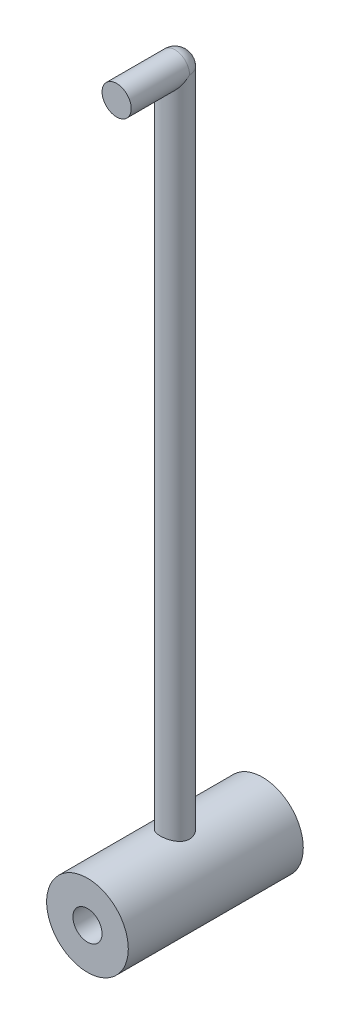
ISO-10303-21;
HEADER;
FILE_DESCRIPTION(('STEP AP214'),'2;1');
FILE_NAME('part.step','',(''),(''),'','','');
FILE_SCHEMA(('AUTOMOTIVE_DESIGN { 1 0 10303 214 1 1 1 1 }'));
ENDSEC;
DATA;
#1=APPLICATION_CONTEXT('core data for automotive mechanical design processes');
#2=APPLICATION_PROTOCOL_DEFINITION('international standard','automotive_design',2000,#1);
#3=PRODUCT_CONTEXT('',#1,'mechanical');
#4=PRODUCT('Part','Part','',(#3));
#5=PRODUCT_RELATED_PRODUCT_CATEGORY('part','',(#4));
#6=PRODUCT_DEFINITION_FORMATION('','',#4);
#7=PRODUCT_DEFINITION_CONTEXT('part definition',#1,'design');
#8=PRODUCT_DEFINITION('design','',#6,#7);
#9=PRODUCT_DEFINITION_SHAPE('','',#8);
#10=(LENGTH_UNIT() NAMED_UNIT(*) SI_UNIT(.MILLI.,.METRE.));
#11=(NAMED_UNIT(*) PLANE_ANGLE_UNIT() SI_UNIT($,.RADIAN.));
#12=(NAMED_UNIT(*) SI_UNIT($,.STERADIAN.) SOLID_ANGLE_UNIT());
#13=UNCERTAINTY_MEASURE_WITH_UNIT(LENGTH_MEASURE(1.E-05),#10,'distance_accuracy_value','');
#14=(GEOMETRIC_REPRESENTATION_CONTEXT(3) GLOBAL_UNCERTAINTY_ASSIGNED_CONTEXT((#13)) GLOBAL_UNIT_ASSIGNED_CONTEXT((#10,
#11,#12)) REPRESENTATION_CONTEXT('',''));
#15=CARTESIAN_POINT('',(0.,0.,0.));
#16=DIRECTION('',(0.,0.,1.));
#17=DIRECTION('',(1.,0.,0.));
#18=AXIS2_PLACEMENT_3D('',#15,#16,#17);
#19=CARTESIAN_POINT('',(0.,120.,0.));
#20=DIRECTION('',(0.,-1.,0.));
#21=DIRECTION('',(0.,0.,-1.));
#22=AXIS2_PLACEMENT_3D('',#19,#20,#21);
#23=CYLINDRICAL_SURFACE('',#22,2.5);
#24=CARTESIAN_POINT('',(0.,7.,-2.5));
#25=CARTESIAN_POINT('',(-0.135839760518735,7.0000020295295,-2.50000282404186));
#26=CARTESIAN_POINT('',(-0.271659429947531,6.99601056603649,-2.48889324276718));
#27=CARTESIAN_POINT('',(-0.539264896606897,6.98048404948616,-2.44490871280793));
#28=CARTESIAN_POINT('',(-0.671050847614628,6.96894928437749,-2.41203459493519));
#29=CARTESIAN_POINT('',(-0.926692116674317,6.93958109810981,-2.32581485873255));
#30=CARTESIAN_POINT('',(-1.05056137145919,6.92175912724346,-2.27250644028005));
#31=CARTESIAN_POINT('',(-1.28759585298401,6.88161078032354,-2.14711128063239));
#32=CARTESIAN_POINT('',(-1.40075850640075,6.85928332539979,-2.07502004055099));
#33=CARTESIAN_POINT('',(-1.61758802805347,6.81147377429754,-1.9111568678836));
#34=CARTESIAN_POINT('',(-1.72078015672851,6.78590827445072,-1.81878126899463));
#35=CARTESIAN_POINT('',(-1.9105819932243,6.73493522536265,-1.61825363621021));
#36=CARTESIAN_POINT('',(-1.99718728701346,6.70952771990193,-1.51009741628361));
#37=CARTESIAN_POINT('',(-2.15423735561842,6.6608007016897,-1.27660220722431));
#38=CARTESIAN_POINT('',(-2.2240352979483,6.63758107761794,-1.15080525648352));
#39=CARTESIAN_POINT('',(-2.34127572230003,6.59714352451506,-0.888296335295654));
#40=CARTESIAN_POINT('',(-2.38872619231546,6.57992345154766,-0.751588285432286));
#41=CARTESIAN_POINT('',(-2.45809130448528,6.55432038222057,-0.476577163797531));
#42=CARTESIAN_POINT('',(-2.48090519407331,6.54562733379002,-0.33853069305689));
#43=CARTESIAN_POINT('',(-2.5031615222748,6.53715061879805,-0.060316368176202));
#44=CARTESIAN_POINT('',(-2.50261249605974,6.53736369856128,0.0798506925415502));
#45=CARTESIAN_POINT('',(-2.4788507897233,6.54640588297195,0.350355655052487));
#46=CARTESIAN_POINT('',(-2.45685161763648,6.55477363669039,0.480818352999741));
#47=CARTESIAN_POINT('',(-2.3928085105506,6.57842082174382,0.736061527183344));
#48=CARTESIAN_POINT('',(-2.35076183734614,6.59370119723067,0.860841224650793));
#49=CARTESIAN_POINT('',(-2.247095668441,6.62975170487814,1.10377374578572));
#50=CARTESIAN_POINT('',(-2.18514195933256,6.65061447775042,1.22176960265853));
#51=CARTESIAN_POINT('',(-2.04365272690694,6.69544469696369,1.44605638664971));
#52=CARTESIAN_POINT('',(-1.96411154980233,6.71941314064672,1.55234353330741));
#53=CARTESIAN_POINT('',(-1.78403149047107,6.76952498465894,1.75695959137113));
#54=CARTESIAN_POINT('',(-1.68251331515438,6.7957122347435,1.85441785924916));
#55=CARTESIAN_POINT('',(-1.46426184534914,6.84605473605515,2.03117168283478));
#56=CARTESIAN_POINT('',(-1.3475266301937,6.87020973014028,2.11046494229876));
#57=CARTESIAN_POINT('',(-1.10010034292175,6.91416998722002,2.2494806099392));
#58=CARTESIAN_POINT('',(-0.969249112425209,6.93391532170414,2.30893823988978));
#59=CARTESIAN_POINT('',(-0.698523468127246,6.96639167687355,2.40471582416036));
#60=CARTESIAN_POINT('',(-0.558652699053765,6.97912551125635,2.44104506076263));
#61=CARTESIAN_POINT('',(-0.281205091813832,6.99566202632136,2.48791915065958));
#62=CARTESIAN_POINT('',(-0.143850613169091,6.99987103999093,2.49963813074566));
#63=CARTESIAN_POINT('',(0.130909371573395,7.00012297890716,2.50034512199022));
#64=CARTESIAN_POINT('',(0.268314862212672,6.99616751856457,2.48933762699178));
#65=CARTESIAN_POINT('',(0.534368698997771,6.98080349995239,2.44581386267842));
#66=CARTESIAN_POINT('',(0.663155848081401,6.96965417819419,2.41404524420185));
#67=CARTESIAN_POINT('',(0.913499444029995,6.94128245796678,2.33086340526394));
#68=CARTESIAN_POINT('',(1.03505494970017,6.9240592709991,2.27944763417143));
#69=CARTESIAN_POINT('',(1.27131790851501,6.88465739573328,2.15684114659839));
#70=CARTESIAN_POINT('',(1.38573546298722,6.86235262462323,2.08513351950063));
#71=CARTESIAN_POINT('',(1.60127936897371,6.81528395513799,1.92457250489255));
#72=CARTESIAN_POINT('',(1.70240114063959,6.79051921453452,1.83571323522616));
#73=CARTESIAN_POINT('',(1.89402292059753,6.73966040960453,1.63787036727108));
#74=CARTESIAN_POINT('',(1.98368681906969,6.71356479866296,1.52807528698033));
#75=CARTESIAN_POINT('',(2.14345525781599,6.6642787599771,1.29445872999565));
#76=CARTESIAN_POINT('',(2.21355884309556,6.64108847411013,1.17063656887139));
#77=CARTESIAN_POINT('',(2.33208686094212,6.60040332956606,0.911935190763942));
#78=CARTESIAN_POINT('',(2.3804881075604,6.58291456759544,0.777044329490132));
#79=CARTESIAN_POINT('',(2.45361419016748,6.55601442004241,0.500239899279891));
#80=CARTESIAN_POINT('',(2.4783518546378,6.54659865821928,0.358330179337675));
#81=CARTESIAN_POINT('',(2.50236255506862,6.53745596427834,0.0804795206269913));
#82=CARTESIAN_POINT('',(2.50304426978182,6.53719306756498,-0.0553232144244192));
#83=CARTESIAN_POINT('',(2.48247035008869,6.54503319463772,-0.324997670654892));
#84=CARTESIAN_POINT('',(2.46121642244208,6.55313556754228,-0.458869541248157));
#85=CARTESIAN_POINT('',(2.39843007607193,6.57636700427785,-0.71750058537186));
#86=CARTESIAN_POINT('',(2.35741961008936,6.59131474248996,-0.84240409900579));
#87=CARTESIAN_POINT('',(2.25672644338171,6.62646329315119,-1.08364268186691));
#88=CARTESIAN_POINT('',(2.19703924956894,6.64666536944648,-1.1999756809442));
#89=CARTESIAN_POINT('',(2.05730313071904,6.69127230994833,-1.42692574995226));
#90=CARTESIAN_POINT('',(1.97640371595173,6.71583400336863,-1.53698804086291));
#91=CARTESIAN_POINT('',(1.79790863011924,6.76580411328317,-1.74242750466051));
#92=CARTESIAN_POINT('',(1.70030791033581,6.79121278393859,-1.83780022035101));
#93=CARTESIAN_POINT('',(1.48566252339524,6.84145445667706,-2.01572190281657));
#94=CARTESIAN_POINT('',(1.36791750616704,6.86620367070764,-2.09745303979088));
#95=CARTESIAN_POINT('',(1.11951131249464,6.91104924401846,-2.23990766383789));
#96=CARTESIAN_POINT('',(0.988851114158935,6.93114595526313,-2.3006327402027));
#97=CARTESIAN_POINT('',(0.717646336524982,6.96446006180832,-2.39914031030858));
#98=CARTESIAN_POINT('',(0.577062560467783,6.97764821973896,-2.43682540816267));
#99=CARTESIAN_POINT('',(0.290976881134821,6.99541542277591,-2.48724887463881));
#100=CARTESIAN_POINT('',(0.145476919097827,6.99999782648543,-2.49999697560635));
#101=CARTESIAN_POINT('',(0.,7.,-2.5));
#102=B_SPLINE_CURVE_WITH_KNOTS('',3,(#24,#25,#26,#27,#28,#29,#30,#31,#32,#33,#34,#35,#36,#37,
#38,#39,#40,#41,#42,#43,#44,#45,#46,#47,#48,#49,#50,#51,#52,#53,#54,#55,#56,#57,#58,#59,#60,#61,
#62,#63,#64,#65,#66,#67,#68,#69,#70,#71,#72,#73,#74,#75,#76,#77,#78,#79,#80,#81,#82,#83,#84,#85,
#86,#87,#88,#89,#90,#91,#92,#93,#94,#95,#96,#97,#98,#99,#100,#101),.UNSPECIFIED.,.T.,.F.,(4,2,2,
2,2,2,2,2,2,2,2,2,2,2,2,2,2,2,2,2,2,2,2,2,2,2,2,2,2,2,2,2,2,2,2,2,2,2,4),(0.,0.406983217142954,
0.813950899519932,1.22018120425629,1.62650889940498,2.04714572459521,2.46789433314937,
2.90289606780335,3.3377421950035,3.75611562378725,4.17433620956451,4.57019246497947,
4.96610280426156,5.36904149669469,5.77210990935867,6.19956653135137,6.62707715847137,
7.06008524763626,7.49291944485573,7.90458529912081,8.31616976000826,8.71369326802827,
9.11126840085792,9.52005856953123,9.92898918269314,10.3593838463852,10.7897995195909,
11.2206739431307,11.6513146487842,12.0566930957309,12.4620400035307,12.8572208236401,
13.2524967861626,13.6670344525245,14.0816976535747,14.5159343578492,14.9501382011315,
15.3861650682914,15.8220217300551),.UNSPECIFIED.);
#103=CARTESIAN_POINT('',(0.,7.,-2.5));
#104=VERTEX_POINT('',#103);
#105=EDGE_CURVE('E11',#104,#104,#102,.T.);
#106=ORIENTED_EDGE('',*,*,#105,.T.);
#107=EDGE_LOOP('',(#106));
#108=FACE_BOUND('',#107,.T.);
#109=CARTESIAN_POINT('',(0.,120.,0.));
#110=DIRECTION('',(0.,-0.707106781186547,-0.707106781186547));
#111=DIRECTION('',(0.,-0.707106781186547,0.707106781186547));
#112=AXIS2_PLACEMENT_3D('',#109,#110,#111);
#113=ELLIPSE('',#112,3.53553390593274,2.5);
#114=CARTESIAN_POINT('',(-2.5,120.,0.));
#115=VERTEX_POINT('',#114);
#116=CARTESIAN_POINT('',(2.5,120.,0.));
#117=VERTEX_POINT('',#116);
#118=EDGE_CURVE('E60',#115,#117,#113,.F.);
#119=ORIENTED_EDGE('',*,*,#118,.F.);
#120=CARTESIAN_POINT('',(0.,120.,0.));
#121=DIRECTION('',(0.,1.,0.));
#122=DIRECTION('',(0.,0.,1.));
#123=AXIS2_PLACEMENT_3D('',#120,#121,#122);
#124=CIRCLE('',#123,2.5);
#125=EDGE_CURVE('E50',#117,#115,#124,.T.);
#126=ORIENTED_EDGE('',*,*,#125,.F.);
#127=EDGE_LOOP('',(#119,#126));
#128=FACE_BOUND('',#127,.T.);
#129=ADVANCED_FACE('F32',(#108,#128),#23,.T.);
#130=CARTESIAN_POINT('',(0.,0.,15.));
#131=DIRECTION('',(0.,0.,-1.));
#132=DIRECTION('',(-1.,0.,0.));
#133=AXIS2_PLACEMENT_3D('',#130,#131,#132);
#134=CYLINDRICAL_SURFACE('',#133,7.);
#135=CARTESIAN_POINT('',(0.,0.,-15.));
#136=DIRECTION('',(0.,0.,1.));
#137=DIRECTION('',(1.,0.,0.));
#138=AXIS2_PLACEMENT_3D('',#135,#136,#137);
#139=CIRCLE('',#138,7.);
#140=CARTESIAN_POINT('',(7.,0.,-15.));
#141=VERTEX_POINT('',#140);
#142=EDGE_CURVE('E64',#141,#141,#139,.T.);
#143=ORIENTED_EDGE('',*,*,#142,.T.);
#144=EDGE_LOOP('',(#143));
#145=FACE_BOUND('',#144,.T.);
#146=CARTESIAN_POINT('',(0.,0.,15.));
#147=DIRECTION('',(0.,0.,1.));
#148=DIRECTION('',(1.,0.,0.));
#149=AXIS2_PLACEMENT_3D('',#146,#147,#148);
#150=CIRCLE('',#149,7.);
#151=CARTESIAN_POINT('',(7.,0.,15.));
#152=VERTEX_POINT('',#151);
#153=EDGE_CURVE('E44',#152,#152,#150,.T.);
#154=ORIENTED_EDGE('',*,*,#153,.F.);
#155=EDGE_LOOP('',(#154));
#156=FACE_BOUND('',#155,.T.);
#157=ORIENTED_EDGE('',*,*,#105,.F.);
#158=EDGE_LOOP('',(#157));
#159=FACE_BOUND('',#158,.T.);
#160=ADVANCED_FACE('F34',(#145,#156,#159),#134,.T.);
#161=CARTESIAN_POINT('',(0.,0.,15.));
#162=DIRECTION('',(0.,0.,1.));
#163=DIRECTION('',(1.,0.,0.));
#164=AXIS2_PLACEMENT_3D('',#161,#162,#163);
#165=PLANE('',#164);
#166=CARTESIAN_POINT('',(0.,0.,15.));
#167=DIRECTION('',(0.,0.,1.));
#168=DIRECTION('',(1.,0.,0.));
#169=AXIS2_PLACEMENT_3D('',#166,#167,#168);
#170=CIRCLE('',#169,2.5);
#171=CARTESIAN_POINT('',(2.5,0.,15.));
#172=VERTEX_POINT('',#171);
#173=EDGE_CURVE('E58',#172,#172,#170,.T.);
#174=ORIENTED_EDGE('',*,*,#173,.F.);
#175=EDGE_LOOP('',(#174));
#176=FACE_BOUND('',#175,.T.);
#177=ORIENTED_EDGE('',*,*,#153,.T.);
#178=EDGE_LOOP('',(#177));
#179=FACE_BOUND('',#178,.T.);
#180=ADVANCED_FACE('F72',(#176,#179),#165,.T.);
#181=CARTESIAN_POINT('',(0.,0.,-15.));
#182=DIRECTION('',(0.,0.,1.));
#183=DIRECTION('',(1.,0.,0.));
#184=AXIS2_PLACEMENT_3D('',#181,#182,#183);
#185=PLANE('',#184);
#186=CARTESIAN_POINT('',(0.,0.,-15.));
#187=DIRECTION('',(0.,0.,-1.));
#188=DIRECTION('',(-1.,0.,0.));
#189=AXIS2_PLACEMENT_3D('',#186,#187,#188);
#190=CIRCLE('',#189,2.5);
#191=CARTESIAN_POINT('',(-2.5,0.,-15.));
#192=VERTEX_POINT('',#191);
#193=EDGE_CURVE('E96',#192,#192,#190,.T.);
#194=ORIENTED_EDGE('',*,*,#193,.F.);
#195=EDGE_LOOP('',(#194));
#196=FACE_BOUND('',#195,.T.);
#197=ORIENTED_EDGE('',*,*,#142,.F.);
#198=EDGE_LOOP('',(#197));
#199=FACE_BOUND('',#198,.T.);
#200=ADVANCED_FACE('F86',(#196,#199),#185,.F.);
#201=CARTESIAN_POINT('',(0.,120.,10.));
#202=DIRECTION('',(0.,0.,-1.));
#203=DIRECTION('',(-1.,0.,0.));
#204=AXIS2_PLACEMENT_3D('',#201,#202,#203);
#205=CYLINDRICAL_SURFACE('',#204,2.5);
#206=CARTESIAN_POINT('',(0.,120.,10.));
#207=DIRECTION('',(0.,0.,1.));
#208=DIRECTION('',(1.,0.,0.));
#209=AXIS2_PLACEMENT_3D('',#206,#207,#208);
#210=CIRCLE('',#209,2.5);
#211=CARTESIAN_POINT('',(2.5,120.,10.));
#212=VERTEX_POINT('',#211);
#213=EDGE_CURVE('E57',#212,#212,#210,.T.);
#214=ORIENTED_EDGE('',*,*,#213,.F.);
#215=EDGE_LOOP('',(#214));
#216=FACE_BOUND('',#215,.T.);
#217=CARTESIAN_POINT('',(0.,120.,0.));
#218=DIRECTION('',(0.,0.,1.));
#219=DIRECTION('',(1.,0.,0.));
#220=AXIS2_PLACEMENT_3D('',#217,#218,#219);
#221=CIRCLE('',#220,2.5);
#222=EDGE_CURVE('E52',#117,#115,#221,.T.);
#223=ORIENTED_EDGE('',*,*,#222,.T.);
#224=ORIENTED_EDGE('',*,*,#118,.T.);
#225=EDGE_LOOP('',(#223,#224));
#226=FACE_BOUND('',#225,.T.);
#227=ADVANCED_FACE('F61',(#216,#226),#205,.T.);
#228=CARTESIAN_POINT('',(0.,120.,10.));
#229=DIRECTION('',(0.,0.,1.));
#230=DIRECTION('',(1.,0.,0.));
#231=AXIS2_PLACEMENT_3D('',#228,#229,#230);
#232=PLANE('',#231);
#233=ORIENTED_EDGE('',*,*,#213,.T.);
#234=EDGE_LOOP('',(#233));
#235=FACE_BOUND('',#234,.T.);
#236=ADVANCED_FACE('F103',(#235),#232,.T.);
#237=CARTESIAN_POINT('',(0.,120.,0.));
#238=DIRECTION('',(1.,0.,0.));
#239=DIRECTION('',(0.,1.,0.));
#240=AXIS2_PLACEMENT_3D('',#237,#238,#239);
#241=SPHERICAL_SURFACE('',#240,2.5);
#242=ORIENTED_EDGE('',*,*,#125,.T.);
#243=ORIENTED_EDGE('',*,*,#222,.F.);
#244=EDGE_LOOP('',(#242,#243));
#245=FACE_BOUND('',#244,.T.);
#246=ADVANCED_FACE('F54',(#245),#241,.T.);
#247=CARTESIAN_POINT('',(0.,0.,34.));
#248=DIRECTION('',(0.,0.,-1.));
#249=DIRECTION('',(-1.,0.,0.));
#250=AXIS2_PLACEMENT_3D('',#247,#248,#249);
#251=CYLINDRICAL_SURFACE('',#250,2.5);
#252=ORIENTED_EDGE('',*,*,#173,.T.);
#253=EDGE_LOOP('',(#252));
#254=FACE_BOUND('',#253,.T.);
#255=ORIENTED_EDGE('',*,*,#193,.T.);
#256=EDGE_LOOP('',(#255));
#257=FACE_BOUND('',#256,.T.);
#258=ADVANCED_FACE('F112',(#254,#257),#251,.F.);
#259=CLOSED_SHELL('',(#129,#160,#180,#200,#227,#236,#246,#258));
#260=MANIFOLD_SOLID_BREP('B2',#259);
#261=ADVANCED_BREP_SHAPE_REPRESENTATION('',(#18,#260),#14);
#262=SHAPE_DEFINITION_REPRESENTATION(#9,#261);
ENDSEC;
END-ISO-10303-21;
